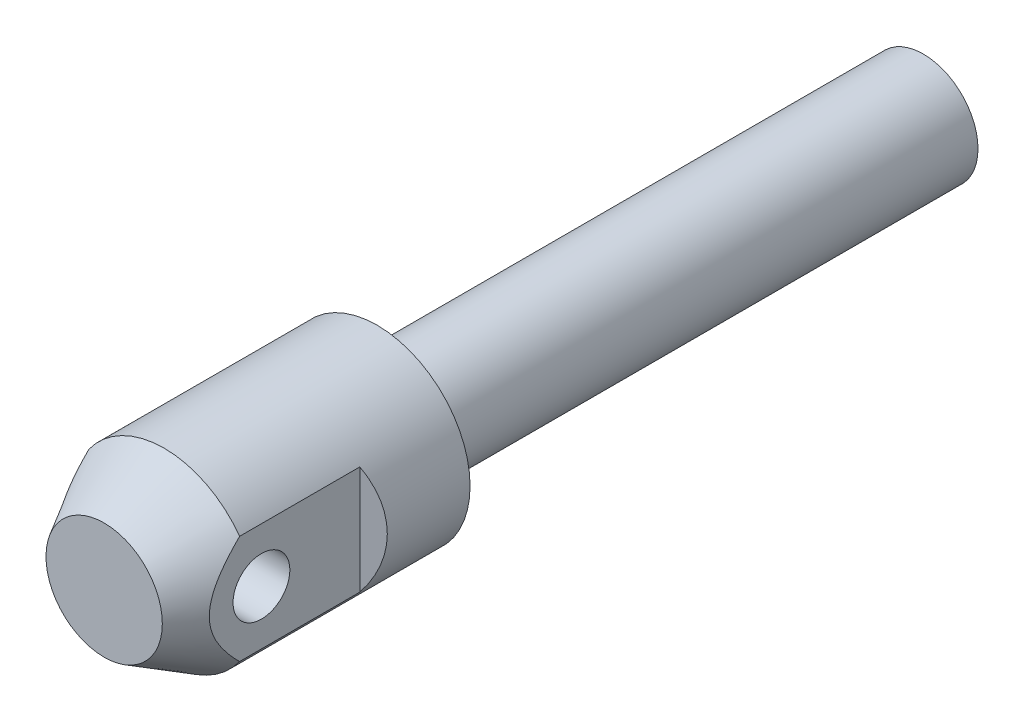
ISO-10303-21;
HEADER;
FILE_DESCRIPTION(('STEP AP214'),'2;1');
FILE_NAME('part.step','',(''),(''),'','','');
FILE_SCHEMA(('AUTOMOTIVE_DESIGN { 1 0 10303 214 1 1 1 1 }'));
ENDSEC;
DATA;
#1=APPLICATION_CONTEXT('core data for automotive mechanical design processes');
#2=APPLICATION_PROTOCOL_DEFINITION('international standard','automotive_design',2000,#1);
#3=PRODUCT_CONTEXT('',#1,'mechanical');
#4=PRODUCT('Part','Part','',(#3));
#5=PRODUCT_RELATED_PRODUCT_CATEGORY('part','',(#4));
#6=PRODUCT_DEFINITION_FORMATION('','',#4);
#7=PRODUCT_DEFINITION_CONTEXT('part definition',#1,'design');
#8=PRODUCT_DEFINITION('design','',#6,#7);
#9=PRODUCT_DEFINITION_SHAPE('','',#8);
#10=(LENGTH_UNIT() NAMED_UNIT(*) SI_UNIT(.MILLI.,.METRE.));
#11=(NAMED_UNIT(*) PLANE_ANGLE_UNIT() SI_UNIT($,.RADIAN.));
#12=(NAMED_UNIT(*) SI_UNIT($,.STERADIAN.) SOLID_ANGLE_UNIT());
#13=UNCERTAINTY_MEASURE_WITH_UNIT(LENGTH_MEASURE(1.E-05),#10,'distance_accuracy_value','');
#14=(GEOMETRIC_REPRESENTATION_CONTEXT(3) GLOBAL_UNCERTAINTY_ASSIGNED_CONTEXT((#13)) GLOBAL_UNIT_ASSIGNED_CONTEXT((#10,
#11,#12)) REPRESENTATION_CONTEXT('',''));
#15=CARTESIAN_POINT('',(0.,0.,0.));
#16=DIRECTION('',(0.,0.,1.));
#17=DIRECTION('',(1.,0.,0.));
#18=AXIS2_PLACEMENT_3D('',#15,#16,#17);
#19=CARTESIAN_POINT('',(0.,0.,20.));
#20=DIRECTION('',(0.,0.,1.));
#21=DIRECTION('',(1.,0.,0.));
#22=AXIS2_PLACEMENT_3D('',#19,#20,#21);
#23=CYLINDRICAL_SURFACE('',#22,8.5);
#24=CARTESIAN_POINT('',(0.,0.,0.));
#25=DIRECTION('',(0.,0.,1.));
#26=DIRECTION('',(1.,0.,0.));
#27=AXIS2_PLACEMENT_3D('',#24,#25,#26);
#28=CIRCLE('',#27,8.5);
#29=CARTESIAN_POINT('',(8.5,0.,0.));
#30=VERTEX_POINT('',#29);
#31=EDGE_CURVE('E82',#30,#30,#28,.T.);
#32=ORIENTED_EDGE('',*,*,#31,.T.);
#33=EDGE_LOOP('',(#32));
#34=FACE_BOUND('',#33,.T.);
#35=CARTESIAN_POINT('',(0.,0.,19.5));
#36=DIRECTION('',(0.,0.,1.));
#37=DIRECTION('',(1.,0.,0.));
#38=AXIS2_PLACEMENT_3D('',#35,#36,#37);
#39=CIRCLE('',#38,8.5);
#40=CARTESIAN_POINT('',(-6.9,-4.96386945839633,19.5));
#41=VERTEX_POINT('',#40);
#42=CARTESIAN_POINT('',(6.9,-4.96386945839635,19.5));
#43=VERTEX_POINT('',#42);
#44=EDGE_CURVE('E67',#41,#43,#39,.T.);
#45=ORIENTED_EDGE('',*,*,#44,.F.);
#46=DIRECTION('',(0.,0.,1.));
#47=VECTOR('',#46,1.);
#48=CARTESIAN_POINT('',(-6.9,-4.96386945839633,20.));
#49=LINE('',#48,#47);
#50=CARTESIAN_POINT('',(-6.9,-4.96386945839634,8.5));
#51=VERTEX_POINT('',#50);
#52=EDGE_CURVE('E30',#41,#51,#49,.F.);
#53=ORIENTED_EDGE('',*,*,#52,.T.);
#54=CARTESIAN_POINT('',(0.,0.,12.4837168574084));
#55=DIRECTION('',(0.5,0.,-0.866025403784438));
#56=DIRECTION('',(0.866025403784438,0.,0.5));
#57=AXIS2_PLACEMENT_3D('',#54,#55,#56);
#58=ELLIPSE('',#57,9.81495457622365,8.5);
#59=CARTESIAN_POINT('',(-6.9,4.96386945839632,8.5));
#60=VERTEX_POINT('',#59);
#61=EDGE_CURVE('E9',#60,#51,#58,.F.);
#62=ORIENTED_EDGE('',*,*,#61,.F.);
#63=DIRECTION('',(0.,0.,1.));
#64=VECTOR('',#63,1.);
#65=CARTESIAN_POINT('',(-6.9,4.96386945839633,20.));
#66=LINE('',#65,#64);
#67=CARTESIAN_POINT('',(-6.9,4.96386945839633,19.5));
#68=VERTEX_POINT('',#67);
#69=EDGE_CURVE('E63',#60,#68,#66,.T.);
#70=ORIENTED_EDGE('',*,*,#69,.T.);
#71=CARTESIAN_POINT('',(6.9,4.96386945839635,19.5));
#72=VERTEX_POINT('',#71);
#73=EDGE_CURVE('E79',#72,#68,#39,.T.);
#74=ORIENTED_EDGE('',*,*,#73,.F.);
#75=DIRECTION('',(0.,0.,1.));
#76=VECTOR('',#75,1.);
#77=CARTESIAN_POINT('',(6.9,4.96386945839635,20.));
#78=LINE('',#77,#76);
#79=CARTESIAN_POINT('',(6.9,4.96386945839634,8.5));
#80=VERTEX_POINT('',#79);
#81=EDGE_CURVE('E38',#80,#72,#78,.T.);
#82=ORIENTED_EDGE('',*,*,#81,.F.);
#83=CARTESIAN_POINT('',(0.,0.,12.4837168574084));
#84=DIRECTION('',(0.5,0.,0.866025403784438));
#85=DIRECTION('',(-0.866025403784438,0.,0.5));
#86=AXIS2_PLACEMENT_3D('',#83,#84,#85);
#87=ELLIPSE('',#86,9.81495457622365,8.5);
#88=CARTESIAN_POINT('',(6.9,-4.96386945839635,8.5));
#89=VERTEX_POINT('',#88);
#90=EDGE_CURVE('E99',#80,#89,#87,.F.);
#91=ORIENTED_EDGE('',*,*,#90,.T.);
#92=DIRECTION('',(0.,0.,1.));
#93=VECTOR('',#92,1.);
#94=CARTESIAN_POINT('',(6.9,-4.96386945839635,20.));
#95=LINE('',#94,#93);
#96=EDGE_CURVE('E74',#43,#89,#95,.F.);
#97=ORIENTED_EDGE('',*,*,#96,.F.);
#98=EDGE_LOOP('',(#45,#53,#62,#70,#74,#82,#91,#97));
#99=FACE_BOUND('',#98,.T.);
#100=ADVANCED_FACE('F14',(#34,#99),#23,.T.);
#101=CARTESIAN_POINT('',(0.,0.,25.));
#102=DIRECTION('',(0.,0.,-1.));
#103=DIRECTION('',(-1.,0.,0.));
#104=AXIS2_PLACEMENT_3D('',#101,#102,#103);
#105=CONICAL_SURFACE('',#104,5.32457351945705,0.523598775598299);
#106=CARTESIAN_POINT('',(0.,0.,25.));
#107=DIRECTION('',(0.,0.,1.));
#108=DIRECTION('',(1.,0.,0.));
#109=AXIS2_PLACEMENT_3D('',#106,#107,#108);
#110=CIRCLE('',#109,5.32457351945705);
#111=CARTESIAN_POINT('',(5.32457351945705,0.,25.));
#112=VERTEX_POINT('',#111);
#113=EDGE_CURVE('E76',#112,#112,#110,.T.);
#114=ORIENTED_EDGE('',*,*,#113,.F.);
#115=EDGE_LOOP('',(#114));
#116=FACE_BOUND('',#115,.T.);
#117=ORIENTED_EDGE('',*,*,#73,.T.);
#118=CARTESIAN_POINT('',(-6.9,-11.7761017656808,10.5822178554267));
#119=CARTESIAN_POINT('',(-6.9,-11.5231895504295,10.9601077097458));
#120=CARTESIAN_POINT('',(-6.9,-11.2688933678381,11.3370811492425));
#121=CARTESIAN_POINT('',(-6.9,-10.7568141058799,12.0887269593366));
#122=CARTESIAN_POINT('',(-6.9,-10.4990305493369,12.463399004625));
#123=CARTESIAN_POINT('',(-6.9,-9.97780567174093,13.2120543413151));
#124=CARTESIAN_POINT('',(-6.9,-9.71434006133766,13.5860207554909));
#125=CARTESIAN_POINT('',(-6.9,-9.18227914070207,14.3302524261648));
#126=CARTESIAN_POINT('',(-6.9,-8.91368421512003,14.7005179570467));
#127=CARTESIAN_POINT('',(-6.9,-8.34932474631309,15.4644043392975));
#128=CARTESIAN_POINT('',(-6.9,-8.05305141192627,15.8576502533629));
#129=CARTESIAN_POINT('',(-6.9,-7.45080501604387,16.6368491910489));
#130=CARTESIAN_POINT('',(-6.9,-7.14482967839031,17.0228004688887));
#131=CARTESIAN_POINT('',(-6.9,-6.6766500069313,17.5933456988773));
#132=CARTESIAN_POINT('',(-6.9,-6.51926271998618,17.7818929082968));
#133=CARTESIAN_POINT('',(-6.9,-6.20075094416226,18.1557986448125));
#134=CARTESIAN_POINT('',(-6.9,-6.03962662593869,18.3411573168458));
#135=CARTESIAN_POINT('',(-6.9,-5.71305851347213,18.7078973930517));
#136=CARTESIAN_POINT('',(-6.9,-5.5476165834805,18.8892804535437));
#137=CARTESIAN_POINT('',(-6.9,-5.21155976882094,19.2471747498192));
#138=CARTESIAN_POINT('',(-6.9,-5.04094553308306,19.4236865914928));
#139=CARTESIAN_POINT('',(-6.9,-4.77365811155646,19.6905380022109));
#140=CARTESIAN_POINT('',(-6.9,-4.67917608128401,19.7830731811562));
#141=CARTESIAN_POINT('',(-6.9,-4.48823074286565,19.9660758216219));
#142=CARTESIAN_POINT('',(-6.9,-4.39176740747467,20.0565432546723));
#143=CARTESIAN_POINT('',(-6.9,-4.09900157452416,20.3244893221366));
#144=CARTESIAN_POINT('',(-6.9,-3.89940853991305,20.4984256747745));
#145=CARTESIAN_POINT('',(-6.9,-3.49142942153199,20.831987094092));
#146=CARTESIAN_POINT('',(-6.9,-3.28313521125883,20.9917237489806));
#147=CARTESIAN_POINT('',(-6.9,-2.85419187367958,21.2936225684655));
#148=CARTESIAN_POINT('',(-6.9,-2.63355523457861,21.4358020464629));
#149=CARTESIAN_POINT('',(-6.9,-2.29148211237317,21.6308550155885));
#150=CARTESIAN_POINT('',(-6.9,-2.17530299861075,21.6929677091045));
#151=CARTESIAN_POINT('',(-6.9,-1.93925517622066,21.8097877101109));
#152=CARTESIAN_POINT('',(-6.9,-1.81938670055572,21.8644954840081));
#153=CARTESIAN_POINT('',(-6.9,-1.57611618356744,21.9651631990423));
#154=CARTESIAN_POINT('',(-6.9,-1.45271707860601,22.0111301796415));
#155=CARTESIAN_POINT('',(-6.9,-1.20262499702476,22.0929750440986));
#156=CARTESIAN_POINT('',(-6.9,-1.07593300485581,22.1288559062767));
#157=CARTESIAN_POINT('',(-6.9,-0.81803747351,22.1896453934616));
#158=CARTESIAN_POINT('',(-6.9,-0.686795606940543,22.2143934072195));
#159=CARTESIAN_POINT('',(-6.9,-0.422520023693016,22.2510678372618));
#160=CARTESIAN_POINT('',(-6.9,-0.28948644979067,22.2629952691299));
#161=CARTESIAN_POINT('',(-6.9,-0.0229498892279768,22.2734421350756));
#162=CARTESIAN_POINT('',(-6.9,0.110552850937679,22.2719677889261));
#163=CARTESIAN_POINT('',(-6.9,0.376736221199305,22.255698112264));
#164=CARTESIAN_POINT('',(-6.9,0.509416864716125,22.240902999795));
#165=CARTESIAN_POINT('',(-6.9,0.75437583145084,22.201658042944));
#166=CARTESIAN_POINT('',(-6.9,0.866921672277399,22.1788401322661));
#167=CARTESIAN_POINT('',(-6.9,1.08992709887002,22.1246116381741));
#168=CARTESIAN_POINT('',(-6.9,1.20038639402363,22.0931998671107));
#169=CARTESIAN_POINT('',(-6.9,1.41880965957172,22.0226572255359));
#170=CARTESIAN_POINT('',(-6.9,1.5267732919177,21.9835253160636));
#171=CARTESIAN_POINT('',(-6.9,1.73997734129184,21.8984603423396));
#172=CARTESIAN_POINT('',(-6.9,1.84521740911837,21.8525264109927));
#173=CARTESIAN_POINT('',(-6.9,2.14889405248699,21.7095499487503));
#174=CARTESIAN_POINT('',(-6.9,2.34358024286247,21.6045045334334));
#175=CARTESIAN_POINT('',(-6.9,2.72313106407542,21.3779419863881));
#176=CARTESIAN_POINT('',(-6.9,2.90798625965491,21.2564094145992));
#177=CARTESIAN_POINT('',(-6.9,3.27087204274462,20.9996234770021));
#178=CARTESIAN_POINT('',(-6.9,3.44880642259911,20.8642351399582));
#179=CARTESIAN_POINT('',(-6.9,3.7098354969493,20.6540525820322));
#180=CARTESIAN_POINT('',(-6.9,3.79584813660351,20.5828248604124));
#181=CARTESIAN_POINT('',(-6.9,3.96609034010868,20.4382705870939));
#182=CARTESIAN_POINT('',(-6.9,4.05031994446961,20.364944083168));
#183=CARTESIAN_POINT('',(-6.9,4.30479429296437,20.138432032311));
#184=CARTESIAN_POINT('',(-6.9,4.47241760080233,19.9822974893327));
#185=CARTESIAN_POINT('',(-6.9,4.80186670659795,19.6640064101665));
#186=CARTESIAN_POINT('',(-6.9,4.96369131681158,19.5018486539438));
#187=CARTESIAN_POINT('',(-6.9,5.28251775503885,19.1726539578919));
#188=CARTESIAN_POINT('',(-6.9,5.43951614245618,19.0056136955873));
#189=CARTESIAN_POINT('',(-6.9,5.74931497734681,18.66767507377));
#190=CARTESIAN_POINT('',(-6.9,5.90211512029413,18.4967764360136));
#191=CARTESIAN_POINT('',(-6.9,6.20467395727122,18.1511845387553));
#192=CARTESIAN_POINT('',(-6.9,6.35441915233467,17.9764794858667));
#193=CARTESIAN_POINT('',(-6.9,6.65077710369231,17.6244291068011));
#194=CARTESIAN_POINT('',(-6.9,6.79738975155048,17.4470836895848));
#195=CARTESIAN_POINT('',(-6.9,7.23319368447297,16.9117145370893));
#196=CARTESIAN_POINT('',(-6.9,7.51832840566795,16.550383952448));
#197=CARTESIAN_POINT('',(-6.9,7.92704025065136,16.0201612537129));
#198=CARTESIAN_POINT('',(-6.9,8.05391970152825,15.8537878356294));
#199=CARTESIAN_POINT('',(-6.9,8.30612549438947,15.5198844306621));
#200=CARTESIAN_POINT('',(-6.9,8.43145194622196,15.3523545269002));
#201=CARTESIAN_POINT('',(-6.9,8.80539763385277,14.8481828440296));
#202=CARTESIAN_POINT('',(-6.9,9.0519473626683,14.5100057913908));
#203=CARTESIAN_POINT('',(-6.9,9.53839906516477,13.8334497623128));
#204=CARTESIAN_POINT('',(-6.9,9.77834058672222,13.4950991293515));
#205=CARTESIAN_POINT('',(-6.9,10.254496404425,12.8158866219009));
#206=CARTESIAN_POINT('',(-6.9,10.4907114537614,12.4750252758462));
#207=CARTESIAN_POINT('',(-6.9,10.7254504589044,12.1331615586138));
#208=B_SPLINE_CURVE_WITH_KNOTS('',3,(#118,#119,#120,#121,#122,#123,#124,#125,#126,#127,#128,
#129,#130,#131,#132,#133,#134,#135,#136,#137,#138,#139,#140,#141,#142,#143,#144,#145,#146,#147,
#148,#149,#150,#151,#152,#153,#154,#155,#156,#157,#158,#159,#160,#161,#162,#163,#164,#165,#166,
#167,#168,#169,#170,#171,#172,#173,#174,#175,#176,#177,#178,#179,#180,#181,#182,#183,#184,#185,
#186,#187,#188,#189,#190,#191,#192,#193,#194,#195,#196,#197,#198,#199,#200,#201,#202,#203,#204,
#205,#206,#207),.UNSPECIFIED.,.F.,.F.,(4,2,2,2,2,2,2,2,2,2,2,2,2,2,2,2,2,2,2,2,2,2,2,2,2,2,2,2,
2,2,2,2,2,2,2,2,2,2,2,2,2,2,2,2,4),(0.,1.36415288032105,2.72849434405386,4.10082414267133,
5.47305143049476,6.95003664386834,8.42737097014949,9.16414178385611,9.90087901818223,
10.6373032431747,11.3736354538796,11.7703519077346,12.1670738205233,12.9608807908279,
13.7477643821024,14.5338657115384,14.9288783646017,15.3238661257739,15.7185344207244,
16.1130860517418,16.5131603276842,16.9132029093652,17.3130598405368,17.7129102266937,
18.0570632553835,18.4012638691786,18.7455108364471,19.0898017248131,19.7522599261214,
20.4153428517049,21.0856446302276,21.4206479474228,21.7556436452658,22.4426581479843,
23.1298125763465,23.8174460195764,24.5051292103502,25.1953821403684,25.8856589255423,
27.2663158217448,27.8940115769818,28.5216626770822,29.7771414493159,31.0214951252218,
32.2655939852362),.UNSPECIFIED.);
#209=EDGE_CURVE('E23',#68,#41,#208,.F.);
#210=ORIENTED_EDGE('',*,*,#209,.T.);
#211=ORIENTED_EDGE('',*,*,#44,.T.);
#212=CARTESIAN_POINT('',(6.9,-11.7761017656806,10.582217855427));
#213=CARTESIAN_POINT('',(6.9,-11.5231895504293,10.960107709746));
#214=CARTESIAN_POINT('',(6.9,-11.2688933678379,11.3370811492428));
#215=CARTESIAN_POINT('',(6.9,-10.7568141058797,12.0887269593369));
#216=CARTESIAN_POINT('',(6.9,-10.4990305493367,12.4633990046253));
#217=CARTESIAN_POINT('',(6.9,-9.97780567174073,13.2120543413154));
#218=CARTESIAN_POINT('',(6.9,-9.71434006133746,13.5860207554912));
#219=CARTESIAN_POINT('',(6.9,-9.18227914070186,14.3302524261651));
#220=CARTESIAN_POINT('',(6.9,-8.91368421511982,14.700517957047));
#221=CARTESIAN_POINT('',(6.9,-8.34932474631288,15.4644043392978));
#222=CARTESIAN_POINT('',(6.9,-8.05305141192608,15.8576502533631));
#223=CARTESIAN_POINT('',(6.9,-7.45080501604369,16.6368491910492));
#224=CARTESIAN_POINT('',(6.9,-7.14482967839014,17.0228004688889));
#225=CARTESIAN_POINT('',(6.9,-6.67665000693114,17.5933456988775));
#226=CARTESIAN_POINT('',(6.9,-6.51926271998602,17.781892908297));
#227=CARTESIAN_POINT('',(6.9,-6.20075094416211,18.1557986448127));
#228=CARTESIAN_POINT('',(6.9,-6.03962662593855,18.3411573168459));
#229=CARTESIAN_POINT('',(6.9,-5.71305851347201,18.7078973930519));
#230=CARTESIAN_POINT('',(6.9,-5.54761658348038,18.8892804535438));
#231=CARTESIAN_POINT('',(6.9,-5.21155976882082,19.2471747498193));
#232=CARTESIAN_POINT('',(6.9,-5.04094553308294,19.4236865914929));
#233=CARTESIAN_POINT('',(6.9,-4.77365811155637,19.690538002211));
#234=CARTESIAN_POINT('',(6.9,-4.67917608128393,19.7830731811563));
#235=CARTESIAN_POINT('',(6.9,-4.48823074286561,19.9660758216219));
#236=CARTESIAN_POINT('',(6.9,-4.39176740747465,20.0565432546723));
#237=CARTESIAN_POINT('',(6.9,-4.0990015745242,20.3244893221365));
#238=CARTESIAN_POINT('',(6.9,-3.89940853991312,20.4984256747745));
#239=CARTESIAN_POINT('',(6.9,-3.49142942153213,20.8319870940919));
#240=CARTESIAN_POINT('',(6.9,-3.28313521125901,20.9917237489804));
#241=CARTESIAN_POINT('',(6.9,-2.85419187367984,21.2936225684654));
#242=CARTESIAN_POINT('',(6.9,-2.63355523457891,21.4358020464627));
#243=CARTESIAN_POINT('',(6.9,-2.29148211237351,21.6308550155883));
#244=CARTESIAN_POINT('',(6.9,-2.17530299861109,21.6929677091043));
#245=CARTESIAN_POINT('',(6.9,-1.93925517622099,21.8097877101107));
#246=CARTESIAN_POINT('',(6.9,-1.81938670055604,21.864495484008));
#247=CARTESIAN_POINT('',(6.9,-1.57611618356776,21.9651631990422));
#248=CARTESIAN_POINT('',(6.9,-1.45271707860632,22.0111301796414));
#249=CARTESIAN_POINT('',(6.9,-1.20262499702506,22.0929750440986));
#250=CARTESIAN_POINT('',(6.9,-1.07593300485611,22.1288559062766));
#251=CARTESIAN_POINT('',(6.9,-0.818037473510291,22.1896453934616));
#252=CARTESIAN_POINT('',(6.9,-0.686795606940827,22.2143934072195));
#253=CARTESIAN_POINT('',(6.9,-0.422520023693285,22.2510678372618));
#254=CARTESIAN_POINT('',(6.9,-0.289486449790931,22.2629952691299));
#255=CARTESIAN_POINT('',(6.9,-0.022949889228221,22.2734421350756));
#256=CARTESIAN_POINT('',(6.9,0.110552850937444,22.2719677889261));
#257=CARTESIAN_POINT('',(6.9,0.376736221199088,22.2556981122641));
#258=CARTESIAN_POINT('',(6.9,0.509416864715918,22.240902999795));
#259=CARTESIAN_POINT('',(6.9,0.754375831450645,22.2016580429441));
#260=CARTESIAN_POINT('',(6.9,0.866921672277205,22.1788401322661));
#261=CARTESIAN_POINT('',(6.9,1.08992709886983,22.1246116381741));
#262=CARTESIAN_POINT('',(6.9,1.20038639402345,22.0931998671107));
#263=CARTESIAN_POINT('',(6.9,1.41880965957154,22.022657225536));
#264=CARTESIAN_POINT('',(6.9,1.52677329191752,21.9835253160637));
#265=CARTESIAN_POINT('',(6.9,1.73997734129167,21.8984603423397));
#266=CARTESIAN_POINT('',(6.9,1.84521740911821,21.8525264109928));
#267=CARTESIAN_POINT('',(6.9,2.14889405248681,21.7095499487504));
#268=CARTESIAN_POINT('',(6.9,2.34358024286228,21.6045045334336));
#269=CARTESIAN_POINT('',(6.9,2.72313106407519,21.3779419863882));
#270=CARTESIAN_POINT('',(6.9,2.90798625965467,21.2564094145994));
#271=CARTESIAN_POINT('',(6.9,3.27087204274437,20.9996234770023));
#272=CARTESIAN_POINT('',(6.9,3.44880642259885,20.8642351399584));
#273=CARTESIAN_POINT('',(6.9,3.70983549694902,20.6540525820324));
#274=CARTESIAN_POINT('',(6.9,3.79584813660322,20.5828248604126));
#275=CARTESIAN_POINT('',(6.9,3.96609034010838,20.4382705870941));
#276=CARTESIAN_POINT('',(6.9,4.05031994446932,20.3649440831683));
#277=CARTESIAN_POINT('',(6.9,4.30479429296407,20.1384320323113));
#278=CARTESIAN_POINT('',(6.9,4.47241760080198,19.982297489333));
#279=CARTESIAN_POINT('',(6.9,4.80186670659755,19.6640064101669));
#280=CARTESIAN_POINT('',(6.9,4.96369131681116,19.5018486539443));
#281=CARTESIAN_POINT('',(6.9,5.2825177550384,19.1726539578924));
#282=CARTESIAN_POINT('',(6.9,5.43951614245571,19.0056136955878));
#283=CARTESIAN_POINT('',(6.9,5.74931497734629,18.6676750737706));
#284=CARTESIAN_POINT('',(6.9,5.90211512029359,18.4967764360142));
#285=CARTESIAN_POINT('',(6.9,6.20467395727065,18.151184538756));
#286=CARTESIAN_POINT('',(6.9,6.35441915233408,17.9764794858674));
#287=CARTESIAN_POINT('',(6.9,6.65077710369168,17.6244291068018));
#288=CARTESIAN_POINT('',(6.9,6.79738975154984,17.4470836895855));
#289=CARTESIAN_POINT('',(6.9,7.23319368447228,16.9117145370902));
#290=CARTESIAN_POINT('',(6.9,7.51832840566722,16.5503839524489));
#291=CARTESIAN_POINT('',(6.9,7.92704025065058,16.0201612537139));
#292=CARTESIAN_POINT('',(6.9,8.05391970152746,15.8537878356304));
#293=CARTESIAN_POINT('',(6.9,8.30612549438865,15.5198844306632));
#294=CARTESIAN_POINT('',(6.9,8.43145194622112,15.3523545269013));
#295=CARTESIAN_POINT('',(6.9,8.80539763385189,14.8481828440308));
#296=CARTESIAN_POINT('',(6.9,9.05194736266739,14.5100057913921));
#297=CARTESIAN_POINT('',(6.9,9.5383990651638,13.8334497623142));
#298=CARTESIAN_POINT('',(6.9,9.77834058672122,13.4950991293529));
#299=CARTESIAN_POINT('',(6.9,10.254496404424,12.8158866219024));
#300=CARTESIAN_POINT('',(6.9,10.4907114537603,12.4750252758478));
#301=CARTESIAN_POINT('',(6.9,10.7254504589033,12.1331615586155));
#302=B_SPLINE_CURVE_WITH_KNOTS('',3,(#212,#213,#214,#215,#216,#217,#218,#219,#220,#221,#222,
#223,#224,#225,#226,#227,#228,#229,#230,#231,#232,#233,#234,#235,#236,#237,#238,#239,#240,#241,
#242,#243,#244,#245,#246,#247,#248,#249,#250,#251,#252,#253,#254,#255,#256,#257,#258,#259,#260,
#261,#262,#263,#264,#265,#266,#267,#268,#269,#270,#271,#272,#273,#274,#275,#276,#277,#278,#279,
#280,#281,#282,#283,#284,#285,#286,#287,#288,#289,#290,#291,#292,#293,#294,#295,#296,#297,#298,
#299,#300,#301),.UNSPECIFIED.,.F.,.F.,(4,2,2,2,2,2,2,2,2,2,2,2,2,2,2,2,2,2,2,2,2,2,2,2,2,2,2,2,
2,2,2,2,2,2,2,2,2,2,2,2,2,2,2,2,4),(0.,1.36415288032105,2.72849434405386,4.10082414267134,
5.47305143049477,6.9500366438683,8.4273709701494,9.16414178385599,9.90087901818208,
10.6373032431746,11.3736354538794,11.7703519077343,12.167073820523,12.9608807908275,
13.7477643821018,14.5338657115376,14.928878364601,15.3238661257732,15.7185344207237,
16.1130860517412,16.5131603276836,16.9132029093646,17.3130598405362,17.7129102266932,
18.057063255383,18.4012638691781,18.7455108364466,19.0898017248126,19.7522599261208,
20.4153428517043,21.0856446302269,21.4206479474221,21.7556436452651,22.4426581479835,
23.1298125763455,23.8174460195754,24.5051292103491,25.1953821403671,25.885658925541,
27.2663158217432,27.8940115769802,28.5216626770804,29.777141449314,31.0214951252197,
32.2655939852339),.UNSPECIFIED.);
#303=EDGE_CURVE('E91',#72,#43,#302,.F.);
#304=ORIENTED_EDGE('',*,*,#303,.F.);
#305=EDGE_LOOP('',(#117,#210,#211,#304));
#306=FACE_BOUND('',#305,.T.);
#307=ADVANCED_FACE('F104',(#116,#306),#105,.T.);
#308=CARTESIAN_POINT('',(0.,5.32457351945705,25.));
#309=DIRECTION('',(0.,0.,-1.));
#310=DIRECTION('',(-1.,0.,0.));
#311=AXIS2_PLACEMENT_3D('',#308,#309,#310);
#312=PLANE('',#311);
#313=ORIENTED_EDGE('',*,*,#113,.T.);
#314=EDGE_LOOP('',(#313));
#315=FACE_BOUND('',#314,.T.);
#316=ADVANCED_FACE('F16',(#315),#312,.F.);
#317=CARTESIAN_POINT('',(0.,5.,-50.));
#318=DIRECTION('',(0.,0.,-1.));
#319=DIRECTION('',(-1.,0.,0.));
#320=AXIS2_PLACEMENT_3D('',#317,#318,#319);
#321=PLANE('',#320);
#322=CARTESIAN_POINT('',(0.,0.,-50.));
#323=DIRECTION('',(0.,0.,1.));
#324=DIRECTION('',(1.,0.,0.));
#325=AXIS2_PLACEMENT_3D('',#322,#323,#324);
#326=CIRCLE('',#325,5.);
#327=CARTESIAN_POINT('',(5.,0.,-50.));
#328=VERTEX_POINT('',#327);
#329=EDGE_CURVE('E88',#328,#328,#326,.T.);
#330=ORIENTED_EDGE('',*,*,#329,.F.);
#331=EDGE_LOOP('',(#330));
#332=FACE_BOUND('',#331,.T.);
#333=ADVANCED_FACE('F147',(#332),#321,.T.);
#334=CARTESIAN_POINT('',(0.,0.,20.));
#335=DIRECTION('',(0.,0.,1.));
#336=DIRECTION('',(1.,0.,0.));
#337=AXIS2_PLACEMENT_3D('',#334,#335,#336);
#338=CYLINDRICAL_SURFACE('',#337,5.);
#339=ORIENTED_EDGE('',*,*,#329,.T.);
#340=EDGE_LOOP('',(#339));
#341=FACE_BOUND('',#340,.T.);
#342=CARTESIAN_POINT('',(0.,0.,0.));
#343=DIRECTION('',(0.,0.,1.));
#344=DIRECTION('',(1.,0.,0.));
#345=AXIS2_PLACEMENT_3D('',#342,#343,#344);
#346=CIRCLE('',#345,5.);
#347=CARTESIAN_POINT('',(5.,0.,0.));
#348=VERTEX_POINT('',#347);
#349=EDGE_CURVE('E85',#348,#348,#346,.T.);
#350=ORIENTED_EDGE('',*,*,#349,.F.);
#351=EDGE_LOOP('',(#350));
#352=FACE_BOUND('',#351,.T.);
#353=ADVANCED_FACE('F134',(#341,#352),#338,.T.);
#354=CARTESIAN_POINT('',(0.,5.,0.));
#355=DIRECTION('',(0.,0.,1.));
#356=DIRECTION('',(1.,0.,0.));
#357=AXIS2_PLACEMENT_3D('',#354,#355,#356);
#358=PLANE('',#357);
#359=ORIENTED_EDGE('',*,*,#31,.F.);
#360=EDGE_LOOP('',(#359));
#361=FACE_BOUND('',#360,.T.);
#362=ORIENTED_EDGE('',*,*,#349,.T.);
#363=EDGE_LOOP('',(#362));
#364=FACE_BOUND('',#363,.T.);
#365=ADVANCED_FACE('F125',(#361,#364),#358,.F.);
#366=CARTESIAN_POINT('',(6.9,-15.,8.5));
#367=DIRECTION('',(0.5,0.,0.866025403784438));
#368=DIRECTION('',(0.866025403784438,0.,-0.5));
#369=AXIS2_PLACEMENT_3D('',#366,#367,#368);
#370=PLANE('',#369);
#371=DIRECTION('',(0.,1.,0.));
#372=VECTOR('',#371,1.);
#373=CARTESIAN_POINT('',(6.9,-15.,8.5));
#374=LINE('',#373,#372);
#375=EDGE_CURVE('E68',#89,#80,#374,.T.);
#376=ORIENTED_EDGE('',*,*,#375,.F.);
#377=ORIENTED_EDGE('',*,*,#90,.F.);
#378=EDGE_LOOP('',(#376,#377));
#379=FACE_BOUND('',#378,.T.);
#380=ADVANCED_FACE('F123',(#379),#370,.T.);
#381=CARTESIAN_POINT('',(6.9,-15.,8.5));
#382=DIRECTION('',(-1.,0.,0.));
#383=DIRECTION('',(0.,0.,1.));
#384=AXIS2_PLACEMENT_3D('',#381,#382,#383);
#385=PLANE('',#384);
#386=CARTESIAN_POINT('',(6.9,0.,17.5));
#387=DIRECTION('',(1.,0.,0.));
#388=DIRECTION('',(0.,0.,-1.));
#389=AXIS2_PLACEMENT_3D('',#386,#387,#388);
#390=CIRCLE('',#389,2.6);
#391=CARTESIAN_POINT('',(6.9,0.,14.9));
#392=VERTEX_POINT('',#391);
#393=EDGE_CURVE('E233',#392,#392,#390,.T.);
#394=ORIENTED_EDGE('',*,*,#393,.F.);
#395=EDGE_LOOP('',(#394));
#396=FACE_BOUND('',#395,.T.);
#397=ORIENTED_EDGE('',*,*,#96,.T.);
#398=ORIENTED_EDGE('',*,*,#375,.T.);
#399=ORIENTED_EDGE('',*,*,#81,.T.);
#400=ORIENTED_EDGE('',*,*,#303,.T.);
#401=EDGE_LOOP('',(#397,#398,#399,#400));
#402=FACE_BOUND('',#401,.T.);
#403=ADVANCED_FACE('F101',(#396,#402),#385,.F.);
#404=CARTESIAN_POINT('',(-6.9,-15.,8.5));
#405=DIRECTION('',(-1.,0.,0.));
#406=DIRECTION('',(0.,0.,1.));
#407=AXIS2_PLACEMENT_3D('',#404,#405,#406);
#408=PLANE('',#407);
#409=CARTESIAN_POINT('',(-6.9,0.,17.5));
#410=DIRECTION('',(-1.,0.,0.));
#411=DIRECTION('',(0.,0.,1.));
#412=AXIS2_PLACEMENT_3D('',#409,#410,#411);
#413=CIRCLE('',#412,2.6);
#414=CARTESIAN_POINT('',(-6.9,0.,20.1));
#415=VERTEX_POINT('',#414);
#416=EDGE_CURVE('E18',#415,#415,#413,.T.);
#417=ORIENTED_EDGE('',*,*,#416,.F.);
#418=EDGE_LOOP('',(#417));
#419=FACE_BOUND('',#418,.T.);
#420=ORIENTED_EDGE('',*,*,#209,.F.);
#421=ORIENTED_EDGE('',*,*,#69,.F.);
#422=DIRECTION('',(0.,1.,0.));
#423=VECTOR('',#422,1.);
#424=CARTESIAN_POINT('',(-6.9,-15.,8.5));
#425=LINE('',#424,#423);
#426=EDGE_CURVE('E59',#51,#60,#425,.T.);
#427=ORIENTED_EDGE('',*,*,#426,.F.);
#428=ORIENTED_EDGE('',*,*,#52,.F.);
#429=EDGE_LOOP('',(#420,#421,#427,#428));
#430=FACE_BOUND('',#429,.T.);
#431=ADVANCED_FACE('F62',(#419,#430),#408,.T.);
#432=CARTESIAN_POINT('',(-6.9,-15.,8.5));
#433=DIRECTION('',(0.5,0.,-0.866025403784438));
#434=DIRECTION('',(-0.866025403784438,0.,-0.5));
#435=AXIS2_PLACEMENT_3D('',#432,#433,#434);
#436=PLANE('',#435);
#437=ORIENTED_EDGE('',*,*,#61,.T.);
#438=ORIENTED_EDGE('',*,*,#426,.T.);
#439=EDGE_LOOP('',(#437,#438));
#440=FACE_BOUND('',#439,.T.);
#441=ADVANCED_FACE('F58',(#440),#436,.F.);
#442=CARTESIAN_POINT('',(-8.5,0.,17.5));
#443=DIRECTION('',(1.,0.,0.));
#444=DIRECTION('',(0.,0.,-1.));
#445=AXIS2_PLACEMENT_3D('',#442,#443,#444);
#446=CYLINDRICAL_SURFACE('',#445,2.6);
#447=ORIENTED_EDGE('',*,*,#416,.T.);
#448=EDGE_LOOP('',(#447));
#449=FACE_BOUND('',#448,.T.);
#450=ORIENTED_EDGE('',*,*,#393,.T.);
#451=EDGE_LOOP('',(#450));
#452=FACE_BOUND('',#451,.T.);
#453=ADVANCED_FACE('F121',(#449,#452),#446,.F.);
#454=CLOSED_SHELL('',(#100,#307,#316,#333,#353,#365,#380,#403,#431,#441,#453));
#455=MANIFOLD_SOLID_BREP('B1',#454);
#456=ADVANCED_BREP_SHAPE_REPRESENTATION('',(#18,#455),#14);
#457=SHAPE_DEFINITION_REPRESENTATION(#9,#456);
ENDSEC;
END-ISO-10303-21;
